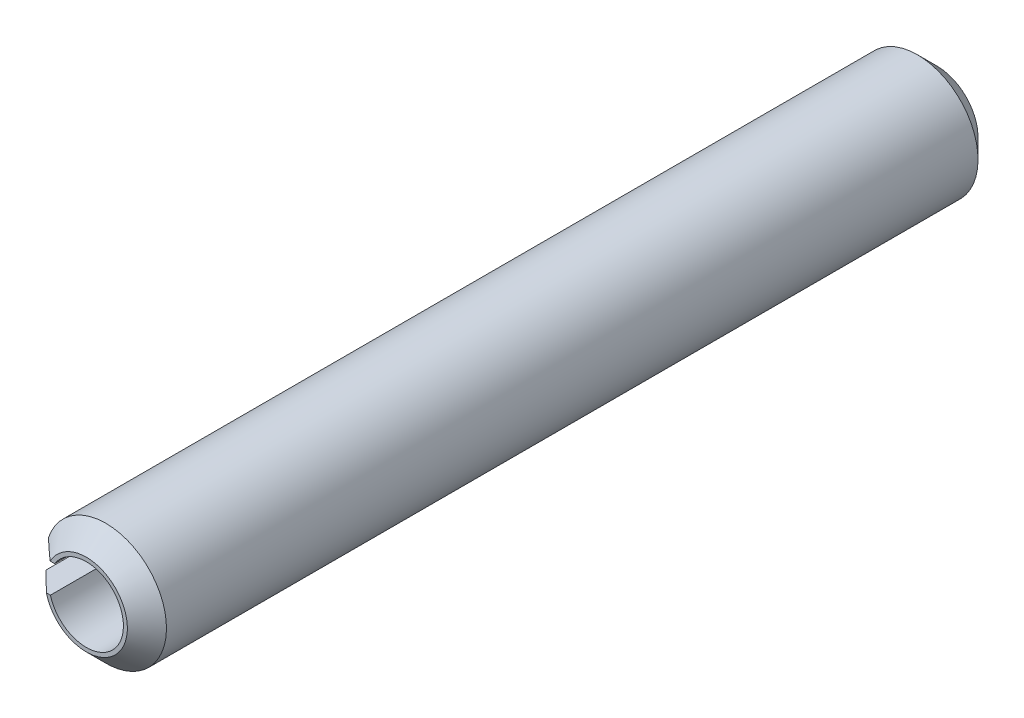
from build123d import *

# Parameters (mm, degrees)
BOSS_EXTRUDE1_DEPTH = 5.5245
CHAMFER2_SIZE       = 0.254


with BuildPart() as part:
    # Sketch1 → Boss-Extrude1 (new, symmetric)
    with BuildSketch(Plane.XY):
        with BuildLine():
            Line((-0.410349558, 0.254), (-0.745307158, 0.254))
            ThreePointArc((-0.745307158, 0.254), (0.784674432, -0.065458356), (-0.777090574, -0.127))
            Line((-0.777090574, -0.127), (-0.465589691, -0.127))
            ThreePointArc((-0.465589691, -0.127), (0.477606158, -0.069246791), (-0.410349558, 0.254))
        make_face()
    extrude(amount=BOSS_EXTRUDE1_DEPTH, both=True)

    # Chamfer2
    chamfer2_edges = [part.edges().sort_by_distance(p)[0] for p in [
        (0.784674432, -0.065458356, 5.5245),
        (0.784674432, -0.065458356, -5.5245),
    ]]
    chamfer(chamfer2_edges, length=CHAMFER2_SIZE)


solid = part.part
